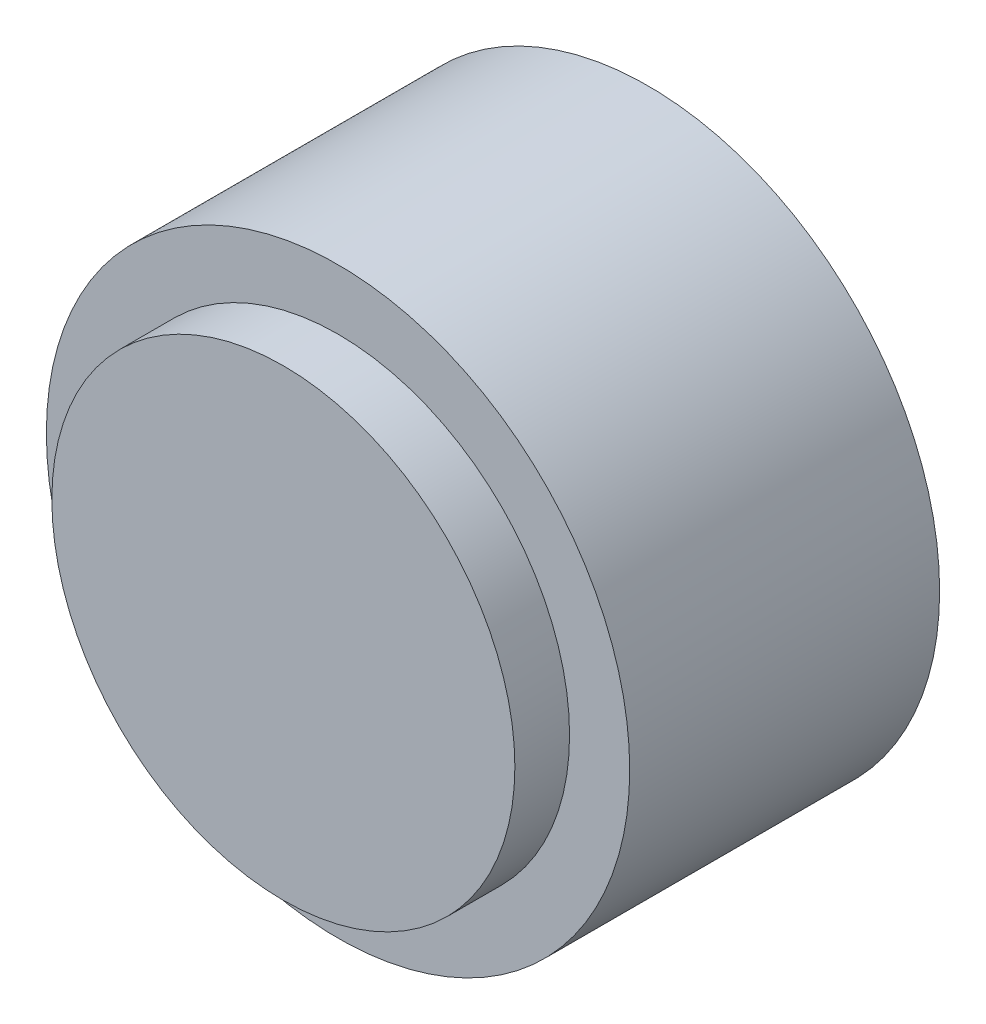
ISO-10303-21;
HEADER;
FILE_DESCRIPTION(('STEP AP214'),'2;1');
FILE_NAME('part.step','',(''),(''),'','','');
FILE_SCHEMA(('AUTOMOTIVE_DESIGN { 1 0 10303 214 1 1 1 1 }'));
ENDSEC;
DATA;
#1=APPLICATION_CONTEXT('core data for automotive mechanical design processes');
#2=APPLICATION_PROTOCOL_DEFINITION('international standard','automotive_design',2000,#1);
#3=PRODUCT_CONTEXT('',#1,'mechanical');
#4=PRODUCT('Part','Part','',(#3));
#5=PRODUCT_RELATED_PRODUCT_CATEGORY('part','',(#4));
#6=PRODUCT_DEFINITION_FORMATION('','',#4);
#7=PRODUCT_DEFINITION_CONTEXT('part definition',#1,'design');
#8=PRODUCT_DEFINITION('design','',#6,#7);
#9=PRODUCT_DEFINITION_SHAPE('','',#8);
#10=(LENGTH_UNIT() NAMED_UNIT(*) SI_UNIT(.MILLI.,.METRE.));
#11=(NAMED_UNIT(*) PLANE_ANGLE_UNIT() SI_UNIT($,.RADIAN.));
#12=(NAMED_UNIT(*) SI_UNIT($,.STERADIAN.) SOLID_ANGLE_UNIT());
#13=UNCERTAINTY_MEASURE_WITH_UNIT(LENGTH_MEASURE(1.E-05),#10,'distance_accuracy_value','');
#14=(GEOMETRIC_REPRESENTATION_CONTEXT(3) GLOBAL_UNCERTAINTY_ASSIGNED_CONTEXT((#13)) GLOBAL_UNIT_ASSIGNED_CONTEXT((#10,
#11,#12)) REPRESENTATION_CONTEXT('',''));
#15=CARTESIAN_POINT('',(0.,0.,0.));
#16=DIRECTION('',(0.,0.,1.));
#17=DIRECTION('',(1.,0.,0.));
#18=AXIS2_PLACEMENT_3D('',#15,#16,#17);
#19=CARTESIAN_POINT('',(0.,0.,30.));
#20=DIRECTION('',(0.,0.,1.));
#21=DIRECTION('',(1.,0.,0.));
#22=AXIS2_PLACEMENT_3D('',#19,#20,#21);
#23=CYLINDRICAL_SURFACE('',#22,8.);
#24=CARTESIAN_POINT('',(0.,0.,0.));
#25=DIRECTION('',(0.,0.,1.));
#26=DIRECTION('',(1.,0.,0.));
#27=AXIS2_PLACEMENT_3D('',#24,#25,#26);
#28=CIRCLE('',#27,8.);
#29=CARTESIAN_POINT('',(8.,0.,0.));
#30=VERTEX_POINT('',#29);
#31=EDGE_CURVE('E8',#30,#30,#28,.T.);
#32=ORIENTED_EDGE('',*,*,#31,.T.);
#33=EDGE_LOOP('',(#32));
#34=FACE_BOUND('',#33,.T.);
#35=CARTESIAN_POINT('',(0.,0.,8.5));
#36=DIRECTION('',(0.,0.,1.));
#37=DIRECTION('',(1.,0.,0.));
#38=AXIS2_PLACEMENT_3D('',#35,#36,#37);
#39=CIRCLE('',#38,8.);
#40=CARTESIAN_POINT('',(8.,0.,8.5));
#41=VERTEX_POINT('',#40);
#42=EDGE_CURVE('E28',#41,#41,#39,.T.);
#43=ORIENTED_EDGE('',*,*,#42,.F.);
#44=EDGE_LOOP('',(#43));
#45=FACE_BOUND('',#44,.T.);
#46=ADVANCED_FACE('F12',(#34,#45),#23,.T.);
#47=CARTESIAN_POINT('',(3.,0.,0.));
#48=DIRECTION('',(0.,0.,1.));
#49=DIRECTION('',(1.,0.,0.));
#50=AXIS2_PLACEMENT_3D('',#47,#48,#49);
#51=PLANE('',#50);
#52=ORIENTED_EDGE('',*,*,#31,.F.);
#53=EDGE_LOOP('',(#52));
#54=FACE_BOUND('',#53,.T.);
#55=CARTESIAN_POINT('',(0.,0.,0.));
#56=DIRECTION('',(0.,0.,1.));
#57=DIRECTION('',(1.,0.,0.));
#58=AXIS2_PLACEMENT_3D('',#55,#56,#57);
#59=CIRCLE('',#58,3.);
#60=CARTESIAN_POINT('',(3.,0.,0.));
#61=VERTEX_POINT('',#60);
#62=EDGE_CURVE('E19',#61,#61,#59,.T.);
#63=ORIENTED_EDGE('',*,*,#62,.T.);
#64=EDGE_LOOP('',(#63));
#65=FACE_BOUND('',#64,.T.);
#66=ADVANCED_FACE('F41',(#54,#65),#51,.F.);
#67=CARTESIAN_POINT('',(0.,0.,30.));
#68=DIRECTION('',(0.,0.,1.));
#69=DIRECTION('',(1.,0.,0.));
#70=AXIS2_PLACEMENT_3D('',#67,#68,#69);
#71=CYLINDRICAL_SURFACE('',#70,3.);
#72=CARTESIAN_POINT('',(0.,0.,5.8));
#73=DIRECTION('',(0.,0.,-1.));
#74=DIRECTION('',(-1.,0.,0.));
#75=AXIS2_PLACEMENT_3D('',#72,#73,#74);
#76=CIRCLE('',#75,3.);
#77=CARTESIAN_POINT('',(-3.,0.,5.8));
#78=VERTEX_POINT('',#77);
#79=EDGE_CURVE('E31',#78,#78,#76,.T.);
#80=ORIENTED_EDGE('',*,*,#79,.F.);
#81=EDGE_LOOP('',(#80));
#82=FACE_BOUND('',#81,.T.);
#83=ORIENTED_EDGE('',*,*,#62,.F.);
#84=EDGE_LOOP('',(#83));
#85=FACE_BOUND('',#84,.T.);
#86=ADVANCED_FACE('F37',(#82,#85),#71,.F.);
#87=CARTESIAN_POINT('',(0.,0.,20.));
#88=DIRECTION('',(0.,0.,1.));
#89=DIRECTION('',(1.,0.,0.));
#90=AXIS2_PLACEMENT_3D('',#87,#88,#89);
#91=CYLINDRICAL_SURFACE('',#90,6.35);
#92=CARTESIAN_POINT('',(0.,0.,8.5));
#93=DIRECTION('',(0.,0.,1.));
#94=DIRECTION('',(1.,0.,0.));
#95=AXIS2_PLACEMENT_3D('',#92,#93,#94);
#96=CIRCLE('',#95,6.35);
#97=CARTESIAN_POINT('',(6.35,0.,8.5));
#98=VERTEX_POINT('',#97);
#99=EDGE_CURVE('E25',#98,#98,#96,.T.);
#100=ORIENTED_EDGE('',*,*,#99,.T.);
#101=EDGE_LOOP('',(#100));
#102=FACE_BOUND('',#101,.T.);
#103=CARTESIAN_POINT('',(0.,0.,10.));
#104=DIRECTION('',(0.,0.,-1.));
#105=DIRECTION('',(-1.,0.,0.));
#106=AXIS2_PLACEMENT_3D('',#103,#104,#105);
#107=CIRCLE('',#106,6.35);
#108=CARTESIAN_POINT('',(-6.35,0.,10.));
#109=VERTEX_POINT('',#108);
#110=EDGE_CURVE('E15',#109,#109,#107,.T.);
#111=ORIENTED_EDGE('',*,*,#110,.T.);
#112=EDGE_LOOP('',(#111));
#113=FACE_BOUND('',#112,.T.);
#114=ADVANCED_FACE('F40',(#102,#113),#91,.T.);
#115=CARTESIAN_POINT('',(-6.35,0.,8.5));
#116=DIRECTION('',(0.,0.,1.));
#117=DIRECTION('',(1.,0.,0.));
#118=AXIS2_PLACEMENT_3D('',#115,#116,#117);
#119=PLANE('',#118);
#120=ORIENTED_EDGE('',*,*,#42,.T.);
#121=EDGE_LOOP('',(#120));
#122=FACE_BOUND('',#121,.T.);
#123=ORIENTED_EDGE('',*,*,#99,.F.);
#124=EDGE_LOOP('',(#123));
#125=FACE_BOUND('',#124,.T.);
#126=ADVANCED_FACE('F56',(#122,#125),#119,.T.);
#127=CARTESIAN_POINT('',(8.,0.,10.));
#128=DIRECTION('',(0.,0.,-1.));
#129=DIRECTION('',(-1.,0.,0.));
#130=AXIS2_PLACEMENT_3D('',#127,#128,#129);
#131=PLANE('',#130);
#132=ORIENTED_EDGE('',*,*,#110,.F.);
#133=EDGE_LOOP('',(#132));
#134=FACE_BOUND('',#133,.T.);
#135=ADVANCED_FACE('F53',(#134),#131,.F.);
#136=CARTESIAN_POINT('',(0.,0.,5.8));
#137=DIRECTION('',(0.,0.,-1.));
#138=DIRECTION('',(-1.,0.,0.));
#139=AXIS2_PLACEMENT_3D('',#136,#137,#138);
#140=PLANE('',#139);
#141=ORIENTED_EDGE('',*,*,#79,.T.);
#142=EDGE_LOOP('',(#141));
#143=FACE_BOUND('',#142,.T.);
#144=ADVANCED_FACE('F35',(#143),#140,.T.);
#145=CLOSED_SHELL('',(#46,#66,#86,#114,#126,#135,#144));
#146=MANIFOLD_SOLID_BREP('B1',#145);
#147=ADVANCED_BREP_SHAPE_REPRESENTATION('',(#18,#146),#14);
#148=SHAPE_DEFINITION_REPRESENTATION(#9,#147);
ENDSEC;
END-ISO-10303-21;
